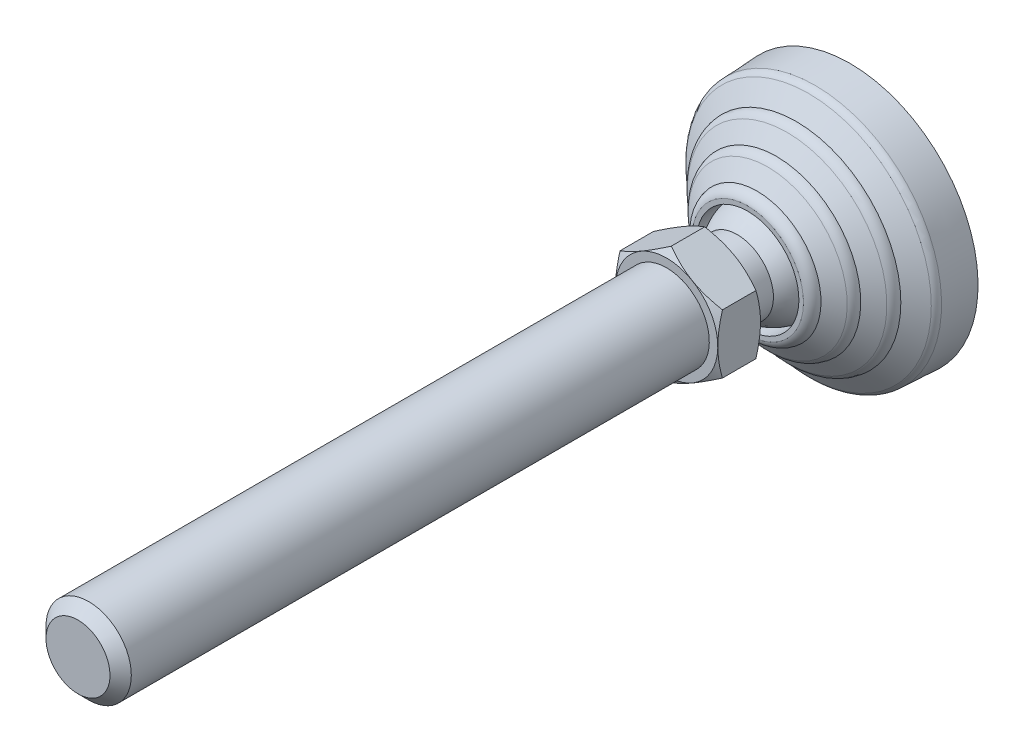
ISO-10303-21;
HEADER;
FILE_DESCRIPTION(('STEP AP214'),'2;1');
FILE_NAME('part.step','',(''),(''),'','','');
FILE_SCHEMA(('AUTOMOTIVE_DESIGN { 1 0 10303 214 1 1 1 1 }'));
ENDSEC;
DATA;
#1=APPLICATION_CONTEXT('core data for automotive mechanical design processes');
#2=APPLICATION_PROTOCOL_DEFINITION('international standard','automotive_design',2000,#1);
#3=PRODUCT_CONTEXT('',#1,'mechanical');
#4=PRODUCT('Part','Part','',(#3));
#5=PRODUCT_RELATED_PRODUCT_CATEGORY('part','',(#4));
#6=PRODUCT_DEFINITION_FORMATION('','',#4);
#7=PRODUCT_DEFINITION_CONTEXT('part definition',#1,'design');
#8=PRODUCT_DEFINITION('design','',#6,#7);
#9=PRODUCT_DEFINITION_SHAPE('','',#8);
#10=(LENGTH_UNIT() NAMED_UNIT(*) SI_UNIT(.MILLI.,.METRE.));
#11=(NAMED_UNIT(*) PLANE_ANGLE_UNIT() SI_UNIT($,.RADIAN.));
#12=(NAMED_UNIT(*) SI_UNIT($,.STERADIAN.) SOLID_ANGLE_UNIT());
#13=UNCERTAINTY_MEASURE_WITH_UNIT(LENGTH_MEASURE(1.E-05),#10,'distance_accuracy_value','');
#14=(GEOMETRIC_REPRESENTATION_CONTEXT(3) GLOBAL_UNCERTAINTY_ASSIGNED_CONTEXT((#13)) GLOBAL_UNIT_ASSIGNED_CONTEXT((#10,
#11,#12)) REPRESENTATION_CONTEXT('',''));
#15=CARTESIAN_POINT('',(0.,0.,0.));
#16=DIRECTION('',(0.,0.,1.));
#17=DIRECTION('',(1.,0.,0.));
#18=AXIS2_PLACEMENT_3D('',#15,#16,#17);
#19=CARTESIAN_POINT('',(0.,0.,110.4665));
#20=DIRECTION('',(0.,0.,-1.));
#21=DIRECTION('',(0.,1.,0.));
#22=AXIS2_PLACEMENT_3D('',#19,#20,#21);
#23=CYLINDRICAL_SURFACE('',#22,10.);
#24=CARTESIAN_POINT('',(0.,0.,178.5));
#25=DIRECTION('',(0.,0.,1.));
#26=DIRECTION('',(0.,-1.,0.));
#27=AXIS2_PLACEMENT_3D('',#24,#25,#26);
#28=CIRCLE('',#27,10.);
#29=CARTESIAN_POINT('',(0.,-10.,178.5));
#30=VERTEX_POINT('',#29);
#31=EDGE_CURVE('E9',#30,#30,#28,.F.);
#32=ORIENTED_EDGE('',*,*,#31,.T.);
#33=EDGE_LOOP('',(#32));
#34=FACE_BOUND('',#33,.T.);
#35=CARTESIAN_POINT('',(0.,0.,43.));
#36=DIRECTION('',(0.,0.,-1.));
#37=DIRECTION('',(0.,1.,0.));
#38=AXIS2_PLACEMENT_3D('',#35,#36,#37);
#39=CIRCLE('',#38,10.);
#40=CARTESIAN_POINT('',(0.,10.,43.));
#41=VERTEX_POINT('',#40);
#42=EDGE_CURVE('E124',#41,#41,#39,.F.);
#43=ORIENTED_EDGE('',*,*,#42,.T.);
#44=EDGE_LOOP('',(#43));
#45=FACE_BOUND('',#44,.T.);
#46=ADVANCED_FACE('F14',(#34,#45),#23,.T.);
#47=CARTESIAN_POINT('',(10.995,0.,43.));
#48=DIRECTION('',(0.,0.,1.));
#49=DIRECTION('',(0.,-1.,0.));
#50=AXIS2_PLACEMENT_3D('',#47,#48,#49);
#51=PLANE('',#50);
#52=CARTESIAN_POINT('',(0.,0.,43.));
#53=DIRECTION('',(0.,0.,-1.));
#54=DIRECTION('',(0.,1.,0.));
#55=AXIS2_PLACEMENT_3D('',#52,#53,#54);
#56=CIRCLE('',#55,11.99);
#57=CARTESIAN_POINT('',(0.,11.99,43.));
#58=VERTEX_POINT('',#57);
#59=EDGE_CURVE('E132',#58,#58,#56,.F.);
#60=ORIENTED_EDGE('',*,*,#59,.T.);
#61=EDGE_LOOP('',(#60));
#62=FACE_BOUND('',#61,.T.);
#63=ORIENTED_EDGE('',*,*,#42,.F.);
#64=EDGE_LOOP('',(#63));
#65=FACE_BOUND('',#64,.T.);
#66=ADVANCED_FACE('F157',(#62,#65),#51,.T.);
#67=CARTESIAN_POINT('',(0.,0.,41.9159643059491));
#68=DIRECTION('',(0.,0.,-1.));
#69=DIRECTION('',(0.,1.,0.));
#70=AXIS2_PLACEMENT_3D('',#67,#68,#69);
#71=CONICAL_SURFACE('',#70,13.8676048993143,1.0471975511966);
#72=ORIENTED_EDGE('',*,*,#59,.F.);
#73=EDGE_LOOP('',(#72));
#74=FACE_BOUND('',#73,.T.);
#75=CARTESIAN_POINT('',(-2.88482840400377E-08,-13.8564064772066,41.9224297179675));
#76=CARTESIAN_POINT('',(0.263784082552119,-13.7041106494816,42.0103407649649));
#77=CARTESIAN_POINT('',(0.528551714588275,-13.5512469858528,42.0942615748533));
#78=CARTESIAN_POINT('',(1.06021019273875,-13.2442938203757,42.2530155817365));
#79=CARTESIAN_POINT('',(1.32710170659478,-13.0902039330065,42.3278457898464));
#80=CARTESIAN_POINT('',(2.13207647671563,-12.6254515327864,42.537252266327));
#81=CARTESIAN_POINT('',(2.67333741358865,-12.3129543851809,42.6563603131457));
#82=CARTESIAN_POINT('',(3.48330954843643,-11.8453167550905,42.796023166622));
#83=CARTESIAN_POINT('',(3.74960108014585,-11.6915732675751,42.8358073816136));
#84=CARTESIAN_POINT('',(4.28341699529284,-11.3833745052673,42.9025217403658));
#85=CARTESIAN_POINT('',(4.55094140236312,-11.2289192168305,42.9294516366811));
#86=CARTESIAN_POINT('',(5.08643614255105,-10.9197511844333,42.9697675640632));
#87=CARTESIAN_POINT('',(5.35440556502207,-10.7650389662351,42.9831696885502));
#88=CARTESIAN_POINT('',(5.8905925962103,-10.4554712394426,42.996144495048));
#89=CARTESIAN_POINT('',(6.15881019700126,-10.3006157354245,42.9957176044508));
#90=CARTESIAN_POINT('',(6.66023029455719,-10.0111207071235,42.9820002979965));
#91=CARTESIAN_POINT('',(6.8934685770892,-9.87646052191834,42.97038309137));
#92=CARTESIAN_POINT('',(7.35940867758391,-9.60744987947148,42.9369099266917));
#93=CARTESIAN_POINT('',(7.59211045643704,-9.47309944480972,42.9150532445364));
#94=CARTESIAN_POINT('',(8.05685109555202,-9.20478131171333,42.8614821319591));
#95=CARTESIAN_POINT('',(8.28888924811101,-9.07081402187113,42.8297595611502));
#96=CARTESIAN_POINT('',(8.75187776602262,-8.80350747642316,42.7570131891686));
#97=CARTESIAN_POINT('',(8.9828280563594,-8.6701682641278,42.7159887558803));
#98=CARTESIAN_POINT('',(9.68388987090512,-8.26541003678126,42.5779256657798));
#99=CARTESIAN_POINT('',(10.1519713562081,-7.99516306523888,42.4671213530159));
#100=CARTESIAN_POINT('',(11.081155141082,-7.45869855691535,42.2156417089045));
#101=CARTESIAN_POINT('',(11.5422693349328,-7.19247415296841,42.075025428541));
#102=CARTESIAN_POINT('',(11.9999999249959,-6.92820327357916,41.922429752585));
#103=B_SPLINE_CURVE_WITH_KNOTS('',3,(#75,#76,#77,#78,#79,#80,#81,#82,#83,#84,#85,#86,#87,#88,
#89,#90,#91,#92,#93,#94,#95,#96,#97,#98,#99,#100,#101,#102),.UNSPECIFIED.,.F.,.F.,(4,2,2,2,2,2,
2,2,2,2,2,2,2,4),(0.,0.950996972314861,1.90230578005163,3.80897261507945,4.73890631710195,
5.66885791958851,6.59770188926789,7.52651715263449,8.33503482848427,9.14360968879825,
9.95285348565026,10.7621522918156,12.4163368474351,14.0672749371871),.UNSPECIFIED.);
#104=CARTESIAN_POINT('',(-1.44241383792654E-08,-13.8564064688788,41.9224297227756));
#105=VERTEX_POINT('',#104);
#106=CARTESIAN_POINT('',(12.,-6.92820324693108,41.9224297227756));
#107=VERTEX_POINT('',#106);
#108=EDGE_CURVE('E143',#105,#107,#103,.T.);
#109=ORIENTED_EDGE('',*,*,#108,.T.);
#110=CARTESIAN_POINT('',(12.,-6.92820326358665,41.9224297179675));
#111=CARTESIAN_POINT('',(12.,-6.64374493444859,42.0045333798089));
#112=CARTESIAN_POINT('',(12.,-6.35829458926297,42.0831531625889));
#113=CARTESIAN_POINT('',(12.,-5.78524260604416,42.2325348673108));
#114=CARTESIAN_POINT('',(12.,-5.49764024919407,42.3032940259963));
#115=CARTESIAN_POINT('',(12.,-4.63053083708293,42.5026195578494));
#116=CARTESIAN_POINT('',(12.,-4.04782834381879,42.6179071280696));
#117=CARTESIAN_POINT('',(12.,-3.17548925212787,42.7575170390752));
#118=CARTESIAN_POINT('',(12.,-2.88840964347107,42.7982045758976));
#119=CARTESIAN_POINT('',(12.,-2.31290718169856,42.8685767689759));
#120=CARTESIAN_POINT('',(12.,-2.02448443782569,42.8982623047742));
#121=CARTESIAN_POINT('',(12.,-1.44696804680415,42.9459902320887));
#122=CARTESIAN_POINT('',(12.,-1.15787537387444,42.9640443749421));
#123=CARTESIAN_POINT('',(12.,-0.579188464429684,42.9881624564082));
#124=CARTESIAN_POINT('',(12.,-0.289594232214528,42.994226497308));
#125=CARTESIAN_POINT('',(12.,0.289594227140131,42.9942264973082));
#126=CARTESIAN_POINT('',(12.,0.579188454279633,42.9881624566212));
#127=CARTESIAN_POINT('',(12.,1.15787535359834,42.9640443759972));
#128=CARTESIAN_POINT('',(12.,1.44696802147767,42.9459902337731));
#129=CARTESIAN_POINT('',(12.,2.02448440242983,42.8982623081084));
#130=CARTESIAN_POINT('',(12.,2.31290714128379,42.8685767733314));
#131=CARTESIAN_POINT('',(12.,2.88840959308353,42.798204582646));
#132=CARTESIAN_POINT('',(12.,3.17548919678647,42.7575170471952));
#133=CARTESIAN_POINT('',(12.,4.04782827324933,42.6179071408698));
#134=CARTESIAN_POINT('',(12.,4.63053075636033,42.5026195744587));
#135=CARTESIAN_POINT('',(12.,5.49764015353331,42.3032940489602));
#136=CARTESIAN_POINT('',(12.,5.78524250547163,42.2325348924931));
#137=CARTESIAN_POINT('',(12.,6.35829447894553,42.0831531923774));
#138=CARTESIAN_POINT('',(12.,6.64374481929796,42.004533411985));
#139=CARTESIAN_POINT('',(12.,6.92820314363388,41.9224297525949));
#140=B_SPLINE_CURVE_WITH_KNOTS('',3,(#110,#111,#112,#113,#114,#115,#116,#117,#118,#119,#120,
#121,#122,#123,#124,#125,#126,#127,#128,#129,#130,#131,#132,#133,#134,#135,#136,#137,#138,#139),
.UNSPECIFIED.,.F.,.F.,(4,2,2,2,2,2,2,2,2,2,2,2,2,2,4),(0.,0.888148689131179,1.77660860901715,
3.55698615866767,4.42666281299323,5.2962699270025,6.16499708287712,7.03371682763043,
7.90243655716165,8.7711636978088,9.64077079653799,10.5104474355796,12.2908249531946,
13.1792848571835,14.0674335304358),.UNSPECIFIED.);
#141=CARTESIAN_POINT('',(12.0000000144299,6.92820322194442,41.9224297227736));
#142=VERTEX_POINT('',#141);
#143=EDGE_CURVE('E135',#107,#142,#140,.T.);
#144=ORIENTED_EDGE('',*,*,#143,.T.);
#145=CARTESIAN_POINT('',(12.0000000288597,6.92820321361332,41.9224297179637));
#146=CARTESIAN_POINT('',(11.7362159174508,7.08049904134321,42.0103407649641));
#147=CARTESIAN_POINT('',(11.4714482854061,7.23336270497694,42.0942615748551));
#148=CARTESIAN_POINT('',(10.9397898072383,7.54031587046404,42.2530155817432));
#149=CARTESIAN_POINT('',(10.6728982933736,7.69440575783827,42.3278457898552));
#150=CARTESIAN_POINT('',(9.86792352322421,8.15915815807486,42.5372522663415));
#151=CARTESIAN_POINT('',(9.32666258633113,8.47165530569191,42.6563603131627));
#152=CARTESIAN_POINT('',(8.51669045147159,8.93929293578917,42.7960231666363));
#153=CARTESIAN_POINT('',(8.25039891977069,9.0930364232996,42.8358073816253));
#154=CARTESIAN_POINT('',(7.71658300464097,9.40123518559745,42.9025217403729));
#155=CARTESIAN_POINT('',(7.44905859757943,9.55569047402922,42.9294516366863));
#156=CARTESIAN_POINT('',(6.91356385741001,9.86485850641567,42.9697675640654));
#157=CARTESIAN_POINT('',(6.64559443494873,10.0195707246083,42.9831696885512));
#158=CARTESIAN_POINT('',(6.10940740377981,10.3291384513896,42.996144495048));
#159=CARTESIAN_POINT('',(5.84118980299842,10.4839939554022,42.9957176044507));
#160=CARTESIAN_POINT('',(5.33976970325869,10.773488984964,42.9820002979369));
#161=CARTESIAN_POINT('',(5.10653141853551,10.9081491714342,42.970383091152));
#162=CARTESIAN_POINT('',(4.64059131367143,11.1771598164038,42.9369099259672));
#163=CARTESIAN_POINT('',(4.4078895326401,11.3115102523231,42.9150532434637));
#164=CARTESIAN_POINT('',(3.94314888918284,11.5798283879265,42.8614821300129));
#165=CARTESIAN_POINT('',(3.71111073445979,11.7137956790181,42.8297595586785));
#166=CARTESIAN_POINT('',(3.24812221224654,11.9811022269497,42.7570131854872));
#167=CARTESIAN_POINT('',(3.01717191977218,12.1144414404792,42.7159887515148));
#168=CARTESIAN_POINT('',(2.31611009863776,12.5191996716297,42.5779256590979));
#169=CARTESIAN_POINT('',(1.84802860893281,12.7894466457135,42.4671213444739));
#170=CARTESIAN_POINT('',(0.918844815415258,13.3259111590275,42.2156416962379));
#171=CARTESIAN_POINT('',(0.457730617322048,13.5921355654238,42.0750254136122));
#172=CARTESIAN_POINT('',(2.30778996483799E-08,13.856406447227,41.9224297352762));
#173=B_SPLINE_CURVE_WITH_KNOTS('',3,(#145,#146,#147,#148,#149,#150,#151,#152,#153,#154,#155,
#156,#157,#158,#159,#160,#161,#162,#163,#164,#165,#166,#167,#168,#169,#170,#171,#172),
.UNSPECIFIED.,.F.,.F.,(4,2,2,2,2,2,2,2,2,2,2,2,2,4),(0.,0.95099697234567,1.9023057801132,
3.8089726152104,4.73890631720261,5.66885791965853,6.59770188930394,7.52651715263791,
8.33503483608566,9.14360970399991,9.95285350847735,10.7621523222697,12.4163368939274,
14.0672749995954),.UNSPECIFIED.);
#174=CARTESIAN_POINT('',(-1.15389591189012E-08,13.856406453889,41.92242973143));
#175=VERTEX_POINT('',#174);
#176=EDGE_CURVE('E180',#142,#175,#173,.T.);
#177=ORIENTED_EDGE('',*,*,#176,.T.);
#178=CARTESIAN_POINT('',(-2.30779115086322E-08,13.856406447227,41.9224297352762));
#179=CARTESIAN_POINT('',(-0.263784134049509,13.7041106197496,42.0103407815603));
#180=CARTESIAN_POINT('',(-0.528551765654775,13.5512469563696,42.0942615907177));
#181=CARTESIAN_POINT('',(-1.06021024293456,13.2442937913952,42.2530155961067));
#182=CARTESIAN_POINT('',(-1.32710175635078,13.0902039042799,42.3278458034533));
#183=CARTESIAN_POINT('',(-2.13207652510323,12.6254515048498,42.5372522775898));
#184=CARTESIAN_POINT('',(-2.6733374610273,12.3129543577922,42.656360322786));
#185=CARTESIAN_POINT('',(-3.48330959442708,11.8453167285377,42.7960231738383));
#186=CARTESIAN_POINT('',(-3.74960112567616,11.6915732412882,42.8358073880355));
#187=CARTESIAN_POINT('',(-4.28341703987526,11.3833744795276,42.9025217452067));
#188=CARTESIAN_POINT('',(-4.550941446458,11.2289191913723,42.9294516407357));
#189=CARTESIAN_POINT('',(-5.08643618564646,10.9197511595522,42.9697675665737));
#190=CARTESIAN_POINT('',(-5.35440560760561,10.7650389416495,42.9831696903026));
#191=CARTESIAN_POINT('',(-5.89059263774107,10.4554712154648,42.9961444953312));
#192=CARTESIAN_POINT('',(-6.15881023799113,10.300615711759,42.9957176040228));
#193=CARTESIAN_POINT('',(-6.66023033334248,10.0111206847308,42.9820002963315));
#194=CARTESIAN_POINT('',(-6.89346861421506,9.87646050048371,42.9703830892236));
#195=CARTESIAN_POINT('',(-7.359408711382,9.60744985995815,42.9369099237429));
#196=CARTESIAN_POINT('',(-7.59211048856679,9.4730994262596,42.9150532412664));
#197=CARTESIAN_POINT('',(-8.05685112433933,9.20478129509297,42.8614821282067));
#198=CARTESIAN_POINT('',(-8.28888927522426,9.07081400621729,42.8297595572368));
#199=CARTESIAN_POINT('',(-8.75187778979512,8.8035074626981,42.7570131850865));
#200=CARTESIAN_POINT('',(-8.98282807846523,8.67016825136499,42.7159887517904));
#201=CARTESIAN_POINT('',(-9.68388988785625,8.26541002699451,42.5779256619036));
#202=CARTESIAN_POINT('',(-10.1519713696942,7.9951630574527,42.4671213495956));
#203=CARTESIAN_POINT('',(-11.0811551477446,7.45869855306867,42.2156417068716));
#204=CARTESIAN_POINT('',(-11.5422693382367,7.19247415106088,42.0750254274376));
#205=CARTESIAN_POINT('',(-11.9999999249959,6.92820327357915,41.922429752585));
#206=B_SPLINE_CURVE_WITH_KNOTS('',3,(#178,#179,#180,#181,#182,#183,#184,#185,#186,#187,#188,
#189,#190,#191,#192,#193,#194,#195,#196,#197,#198,#199,#200,#201,#202,#203,#204,#205),
.UNSPECIFIED.,.F.,.F.,(4,2,2,2,2,2,2,2,2,2,2,2,2,4),(0.,0.9509969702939,1.90230577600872,
3.80897260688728,4.73890630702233,5.6688579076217,6.59770187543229,7.52651713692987,
8.33503480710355,9.14360966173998,9.95285345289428,10.7621522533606,12.4163367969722,
14.0672748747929),.UNSPECIFIED.);
#207=CARTESIAN_POINT('',(-12.,6.92820324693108,41.9224297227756));
#208=VERTEX_POINT('',#207);
#209=EDGE_CURVE('E172',#175,#208,#206,.T.);
#210=ORIENTED_EDGE('',*,*,#209,.T.);
#211=CARTESIAN_POINT('',(-12.,6.92820326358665,41.9224297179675));
#212=CARTESIAN_POINT('',(-12.,6.64374493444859,42.0045333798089));
#213=CARTESIAN_POINT('',(-12.,6.35829458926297,42.0831531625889));
#214=CARTESIAN_POINT('',(-12.,5.78524260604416,42.2325348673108));
#215=CARTESIAN_POINT('',(-12.,5.49764024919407,42.3032940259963));
#216=CARTESIAN_POINT('',(-12.,4.63053083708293,42.5026195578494));
#217=CARTESIAN_POINT('',(-12.,4.04782834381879,42.6179071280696));
#218=CARTESIAN_POINT('',(-12.,3.17548925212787,42.7575170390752));
#219=CARTESIAN_POINT('',(-12.,2.88840964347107,42.7982045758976));
#220=CARTESIAN_POINT('',(-12.,2.31290718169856,42.8685767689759));
#221=CARTESIAN_POINT('',(-12.,2.02448443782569,42.8982623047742));
#222=CARTESIAN_POINT('',(-12.,1.44696804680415,42.9459902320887));
#223=CARTESIAN_POINT('',(-12.,1.15787537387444,42.9640443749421));
#224=CARTESIAN_POINT('',(-12.,0.579188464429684,42.9881624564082));
#225=CARTESIAN_POINT('',(-12.,0.289594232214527,42.994226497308));
#226=CARTESIAN_POINT('',(-12.,-0.289594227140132,42.9942264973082));
#227=CARTESIAN_POINT('',(-12.,-0.579188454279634,42.9881624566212));
#228=CARTESIAN_POINT('',(-12.,-1.15787535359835,42.9640443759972));
#229=CARTESIAN_POINT('',(-12.,-1.44696802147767,42.9459902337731));
#230=CARTESIAN_POINT('',(-12.,-2.02448440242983,42.8982623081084));
#231=CARTESIAN_POINT('',(-12.,-2.31290714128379,42.8685767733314));
#232=CARTESIAN_POINT('',(-12.,-2.88840959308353,42.798204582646));
#233=CARTESIAN_POINT('',(-12.,-3.17548919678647,42.7575170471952));
#234=CARTESIAN_POINT('',(-12.,-4.04782827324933,42.6179071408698));
#235=CARTESIAN_POINT('',(-12.,-4.63053075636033,42.5026195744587));
#236=CARTESIAN_POINT('',(-12.,-5.49764015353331,42.3032940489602));
#237=CARTESIAN_POINT('',(-12.,-5.78524250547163,42.2325348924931));
#238=CARTESIAN_POINT('',(-12.,-6.35829447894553,42.0831531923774));
#239=CARTESIAN_POINT('',(-12.,-6.64374481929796,42.004533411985));
#240=CARTESIAN_POINT('',(-12.,-6.92820314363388,41.9224297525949));
#241=B_SPLINE_CURVE_WITH_KNOTS('',3,(#211,#212,#213,#214,#215,#216,#217,#218,#219,#220,#221,
#222,#223,#224,#225,#226,#227,#228,#229,#230,#231,#232,#233,#234,#235,#236,#237,#238,#239,#240),
.UNSPECIFIED.,.F.,.F.,(4,2,2,2,2,2,2,2,2,2,2,2,2,2,4),(0.,0.888148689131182,1.77660860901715,
3.55698615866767,4.42666281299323,5.2962699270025,6.16499708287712,7.03371682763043,
7.90243655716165,8.7711636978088,9.64077079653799,10.5104474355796,12.2908249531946,
13.1792848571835,14.0674335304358),.UNSPECIFIED.);
#242=CARTESIAN_POINT('',(-12.0000000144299,-6.92820322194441,41.9224297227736));
#243=VERTEX_POINT('',#242);
#244=EDGE_CURVE('E342',#208,#243,#241,.T.);
#245=ORIENTED_EDGE('',*,*,#244,.T.);
#246=CARTESIAN_POINT('',(-12.0000000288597,-6.92820321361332,41.9224297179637));
#247=CARTESIAN_POINT('',(-11.7362159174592,-7.08049904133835,42.0103407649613));
#248=CARTESIAN_POINT('',(-11.471448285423,-7.23336270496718,42.0942615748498));
#249=CARTESIAN_POINT('',(-10.9397898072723,-7.54031587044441,42.2530155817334));
#250=CARTESIAN_POINT('',(-10.6728982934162,-7.69440575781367,42.3278457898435));
#251=CARTESIAN_POINT('',(-9.86792352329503,-8.15915815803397,42.5372522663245));
#252=CARTESIAN_POINT('',(-9.3266625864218,-8.47165530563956,42.6563603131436));
#253=CARTESIAN_POINT('',(-8.5166904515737,-8.93929293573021,42.7960231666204));
#254=CARTESIAN_POINT('',(-8.25039891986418,-9.09303642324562,42.8358073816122));
#255=CARTESIAN_POINT('',(-7.71658300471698,-9.40123518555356,42.9025217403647));
#256=CARTESIAN_POINT('',(-7.44905859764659,-9.55569047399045,42.9294516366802));
#257=CARTESIAN_POINT('',(-6.91356385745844,-9.8648585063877,42.9697675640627));
#258=CARTESIAN_POINT('',(-6.64559443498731,-10.019570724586,42.9831696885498));
#259=CARTESIAN_POINT('',(-6.10940740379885,-10.3291384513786,42.996144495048));
#260=CARTESIAN_POINT('',(-5.84118980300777,-10.4839939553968,42.9957176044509));
#261=CARTESIAN_POINT('',(-5.33976970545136,-10.7734889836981,42.9820002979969));
#262=CARTESIAN_POINT('',(-5.10653142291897,-10.9081491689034,42.9703830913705));
#263=CARTESIAN_POINT('',(-4.64059132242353,-11.1771598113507,42.9369099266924));
#264=CARTESIAN_POINT('',(-4.40788954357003,-11.3115102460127,42.9150532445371));
#265=CARTESIAN_POINT('',(-3.94314890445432,-11.5798283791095,42.8614821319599));
#266=CARTESIAN_POINT('',(-3.71111075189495,-11.7137956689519,42.829759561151));
#267=CARTESIAN_POINT('',(-3.24812223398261,-11.9811022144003,42.7570131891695));
#268=CARTESIAN_POINT('',(-3.01717194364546,-12.1144414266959,42.7159887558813));
#269=CARTESIAN_POINT('',(-2.3161101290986,-12.5191996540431,42.5779256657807));
#270=CARTESIAN_POINT('',(-1.84802864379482,-12.7894466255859,42.4671213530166));
#271=CARTESIAN_POINT('',(-0.918844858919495,-13.3259111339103,42.215641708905));
#272=CARTESIAN_POINT('',(-0.457730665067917,-13.5921355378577,42.0750254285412));
#273=CARTESIAN_POINT('',(-7.50040961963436E-08,-13.8564064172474,41.922429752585));
#274=B_SPLINE_CURVE_WITH_KNOTS('',3,(#246,#247,#248,#249,#250,#251,#252,#253,#254,#255,#256,
#257,#258,#259,#260,#261,#262,#263,#264,#265,#266,#267,#268,#269,#270,#271,#272,#273),
.UNSPECIFIED.,.F.,.F.,(4,2,2,2,2,2,2,2,2,2,2,2,2,4),(0.,0.950996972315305,1.90230578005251,
3.80897261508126,4.73890631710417,5.66885791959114,6.59770188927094,7.52651715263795,
8.33503482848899,9.14360968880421,9.95285348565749,10.7621522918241,12.4163368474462,
14.0672749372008),.UNSPECIFIED.);
#275=EDGE_CURVE('E162',#243,#105,#274,.T.);
#276=ORIENTED_EDGE('',*,*,#275,.T.);
#277=EDGE_LOOP('',(#109,#144,#177,#210,#245,#276));
#278=FACE_BOUND('',#277,.T.);
#279=ADVANCED_FACE('F152',(#74,#278),#71,.T.);
#280=CARTESIAN_POINT('',(0.,-13.856406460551,43.1));
#281=DIRECTION('',(0.5,0.866025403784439,0.));
#282=DIRECTION('',(-0.866025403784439,0.5,0.));
#283=AXIS2_PLACEMENT_3D('',#280,#281,#282);
#284=PLANE('',#283);
#285=DIRECTION('',(0.,0.,1.));
#286=VECTOR('',#285,1.);
#287=CARTESIAN_POINT('',(0.,-13.856406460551,43.1));
#288=LINE('',#287,#286);
#289=CARTESIAN_POINT('',(0.,-13.856406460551,34.0775702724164));
#290=VERTEX_POINT('',#289);
#291=EDGE_CURVE('E368',#290,#105,#288,.T.);
#292=ORIENTED_EDGE('',*,*,#291,.T.);
#293=ORIENTED_EDGE('',*,*,#275,.F.);
#294=DIRECTION('',(0.,0.,1.));
#295=VECTOR('',#294,1.);
#296=CARTESIAN_POINT('',(-12.,-6.9282032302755,43.1));
#297=LINE('',#296,#295);
#298=CARTESIAN_POINT('',(-12.,-6.9282032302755,34.0775702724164));
#299=VERTEX_POINT('',#298);
#300=EDGE_CURVE('E360',#299,#243,#297,.T.);
#301=ORIENTED_EDGE('',*,*,#300,.F.);
#302=CARTESIAN_POINT('',(0.,-13.856406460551,34.0775702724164));
#303=CARTESIAN_POINT('',(-0.263784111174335,-13.7041106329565,33.9896592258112));
#304=CARTESIAN_POINT('',(-0.528551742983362,-13.5512469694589,33.9057384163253));
#305=CARTESIAN_POINT('',(-1.0602102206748,-13.2442938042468,33.7469844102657));
#306=CARTESIAN_POINT('',(-1.32710173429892,-13.0902039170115,33.6721542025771));
#307=CARTESIAN_POINT('',(-2.13207650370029,-12.6254515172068,33.4627477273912));
#308=CARTESIAN_POINT('',(-2.67333744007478,-12.3129543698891,33.3436396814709));
#309=CARTESIAN_POINT('',(-3.48330957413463,-11.8453167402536,33.2039768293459));
#310=CARTESIAN_POINT('',(-3.74960110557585,-11.6915732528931,33.1641926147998));
#311=CARTESIAN_POINT('',(-4.28341702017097,-11.3833744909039,33.097478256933));
#312=CARTESIAN_POINT('',(-4.55094142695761,-11.2289192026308,33.0705483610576));
#313=CARTESIAN_POINT('',(-5.08643616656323,-10.9197511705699,33.0302324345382));
#314=CARTESIAN_POINT('',(-5.35440558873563,-10.765038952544,33.0168303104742));
#315=CARTESIAN_POINT('',(-5.89059261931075,-10.4554712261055,33.0038555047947));
#316=CARTESIAN_POINT('',(-6.15881021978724,-10.300615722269,33.0042823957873));
#317=CARTESIAN_POINT('',(-6.66023031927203,-10.0111206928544,33.0179997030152));
#318=CARTESIAN_POINT('',(-6.8934686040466,-9.87646050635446,33.029616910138));
#319=CARTESIAN_POINT('',(-7.35940870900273,-9.6074498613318,33.063090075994));
#320=CARTESIAN_POINT('',(-7.59211049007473,-9.47309942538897,33.0849467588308));
#321=CARTESIAN_POINT('',(-8.05685113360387,-9.20478128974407,33.1385178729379));
#322=CARTESIAN_POINT('',(-8.28888928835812,-9.07081399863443,33.1702404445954));
#323=CARTESIAN_POINT('',(-8.75187781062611,-8.8035074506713,33.2429868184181));
#324=CARTESIAN_POINT('',(-8.98282810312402,-8.67016823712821,33.2840112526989));
#325=CARTESIAN_POINT('',(-9.6838899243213,-8.2654100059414,33.4220743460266));
#326=CARTESIAN_POINT('',(-10.1519714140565,-7.99516303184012,33.5328786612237));
#327=CARTESIAN_POINT('',(-11.0811552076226,-7.45869851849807,33.7843583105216));
#328=CARTESIAN_POINT('',(-11.5422694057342,-7.19247411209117,33.924974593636));
#329=CARTESIAN_POINT('',(-12.,-6.9282032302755,34.0775702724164));
#330=B_SPLINE_CURVE_WITH_KNOTS('',3,(#302,#303,#304,#305,#306,#307,#308,#309,#310,#311,#312,
#313,#314,#315,#316,#317,#318,#319,#320,#321,#322,#323,#324,#325,#326,#327,#328,#329),
.UNSPECIFIED.,.F.,.F.,(4,2,2,2,2,2,2,2,2,2,2,2,2,4),(0.,0.950996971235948,1.90230577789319,
3.80897261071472,4.73890631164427,5.66885791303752,6.59770188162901,7.52651714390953,
8.33503482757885,9.14360969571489,9.9528535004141,10.7621523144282,12.4163368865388,
14.0672749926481),.UNSPECIFIED.);
#331=EDGE_CURVE('E362',#290,#299,#330,.T.);
#332=ORIENTED_EDGE('',*,*,#331,.F.);
#333=EDGE_LOOP('',(#292,#293,#301,#332));
#334=FACE_BOUND('',#333,.T.);
#335=ADVANCED_FACE('F156',(#334),#284,.F.);
#336=CARTESIAN_POINT('',(12.,-6.92820323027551,43.1));
#337=DIRECTION('',(-0.5,0.866025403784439,0.));
#338=DIRECTION('',(-0.866025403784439,-0.5,0.));
#339=AXIS2_PLACEMENT_3D('',#336,#337,#338);
#340=PLANE('',#339);
#341=DIRECTION('',(0.,0.,1.));
#342=VECTOR('',#341,1.);
#343=CARTESIAN_POINT('',(12.,-6.92820323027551,43.1));
#344=LINE('',#343,#342);
#345=CARTESIAN_POINT('',(12.,-6.92820323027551,34.0775702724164));
#346=VERTEX_POINT('',#345);
#347=EDGE_CURVE('E31',#346,#107,#344,.T.);
#348=ORIENTED_EDGE('',*,*,#347,.T.);
#349=ORIENTED_EDGE('',*,*,#108,.F.);
#350=ORIENTED_EDGE('',*,*,#291,.F.);
#351=CARTESIAN_POINT('',(12.,-6.92820323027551,34.0775702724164));
#352=CARTESIAN_POINT('',(11.7362158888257,-7.08049905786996,33.9896592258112));
#353=CARTESIAN_POINT('',(11.4714482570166,-7.2333627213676,33.9057384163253));
#354=CARTESIAN_POINT('',(10.9397897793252,-7.5403158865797,33.7469844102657));
#355=CARTESIAN_POINT('',(10.6728982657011,-7.69440577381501,33.6721542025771));
#356=CARTESIAN_POINT('',(9.86792349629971,-8.15915817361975,33.4627477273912));
#357=CARTESIAN_POINT('',(9.32666255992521,-8.4716553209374,33.3436396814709));
#358=CARTESIAN_POINT('',(8.51669042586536,-8.93929295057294,33.2039768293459));
#359=CARTESIAN_POINT('',(8.25039889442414,-9.09303643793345,33.1641926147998));
#360=CARTESIAN_POINT('',(7.71658297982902,-9.40123519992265,33.097478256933));
#361=CARTESIAN_POINT('',(7.44905857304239,-9.55569048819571,33.0705483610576));
#362=CARTESIAN_POINT('',(6.91356383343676,-9.86485852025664,33.0302324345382));
#363=CARTESIAN_POINT('',(6.64559441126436,-10.0195707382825,33.0168303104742));
#364=CARTESIAN_POINT('',(6.10940738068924,-10.329138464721,33.0038555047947));
#365=CARTESIAN_POINT('',(5.84118978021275,-10.4839939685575,33.0042823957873));
#366=CARTESIAN_POINT('',(5.33976968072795,-10.7734889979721,33.0179997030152));
#367=CARTESIAN_POINT('',(5.10653139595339,-10.9081491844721,33.029616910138));
#368=CARTESIAN_POINT('',(4.64059129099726,-11.1771598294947,33.063090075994));
#369=CARTESIAN_POINT('',(4.40788950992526,-11.3115102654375,33.0849467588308));
#370=CARTESIAN_POINT('',(3.94314886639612,-11.5798284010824,33.1385178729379));
#371=CARTESIAN_POINT('',(3.71111071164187,-11.7137956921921,33.1702404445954));
#372=CARTESIAN_POINT('',(3.24812218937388,-11.9811022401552,33.2429868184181));
#373=CARTESIAN_POINT('',(3.01717189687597,-12.1144414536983,33.2840112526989));
#374=CARTESIAN_POINT('',(2.3161100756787,-12.5191996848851,33.4220743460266));
#375=CARTESIAN_POINT('',(1.84802858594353,-12.7894466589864,33.5328786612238));
#376=CARTESIAN_POINT('',(0.918844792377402,-13.3259111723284,33.7843583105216));
#377=CARTESIAN_POINT('',(0.457730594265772,-13.5921355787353,33.924974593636));
#378=CARTESIAN_POINT('',(0.,-13.856406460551,34.0775702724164));
#379=B_SPLINE_CURVE_WITH_KNOTS('',3,(#351,#352,#353,#354,#355,#356,#357,#358,#359,#360,#361,
#362,#363,#364,#365,#366,#367,#368,#369,#370,#371,#372,#373,#374,#375,#376,#377,#378),
.UNSPECIFIED.,.F.,.F.,(4,2,2,2,2,2,2,2,2,2,2,2,2,4),(0.,0.95099697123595,1.90230577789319,
3.80897261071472,4.73890631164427,5.66885791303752,6.59770188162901,7.52651714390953,
8.33503482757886,9.14360969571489,9.9528535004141,10.7621523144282,12.4163368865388,
14.0672749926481),.UNSPECIFIED.);
#380=EDGE_CURVE('E369',#346,#290,#379,.T.);
#381=ORIENTED_EDGE('',*,*,#380,.F.);
#382=EDGE_LOOP('',(#348,#349,#350,#381));
#383=FACE_BOUND('',#382,.T.);
#384=ADVANCED_FACE('F375',(#383),#340,.F.);
#385=CARTESIAN_POINT('',(-12.,6.92820323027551,43.1));
#386=DIRECTION('',(0.5,-0.866025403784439,0.));
#387=DIRECTION('',(0.866025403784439,0.5,0.));
#388=AXIS2_PLACEMENT_3D('',#385,#386,#387);
#389=PLANE('',#388);
#390=DIRECTION('',(0.,0.,1.));
#391=VECTOR('',#390,1.);
#392=CARTESIAN_POINT('',(-12.,6.92820323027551,43.1));
#393=LINE('',#392,#391);
#394=CARTESIAN_POINT('',(-12.,6.92820323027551,34.0775702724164));
#395=VERTEX_POINT('',#394);
#396=EDGE_CURVE('E361',#395,#208,#393,.T.);
#397=ORIENTED_EDGE('',*,*,#396,.T.);
#398=ORIENTED_EDGE('',*,*,#209,.F.);
#399=DIRECTION('',(0.,0.,1.));
#400=VECTOR('',#399,1.);
#401=CARTESIAN_POINT('',(0.,13.856406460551,43.1));
#402=LINE('',#401,#400);
#403=CARTESIAN_POINT('',(0.,13.856406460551,34.0775702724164));
#404=VERTEX_POINT('',#403);
#405=EDGE_CURVE('E211',#404,#175,#402,.T.);
#406=ORIENTED_EDGE('',*,*,#405,.F.);
#407=CARTESIAN_POINT('',(-12.,6.92820323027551,34.0775702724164));
#408=CARTESIAN_POINT('',(-11.7362158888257,7.08049905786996,33.9896592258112));
#409=CARTESIAN_POINT('',(-11.4714482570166,7.2333627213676,33.9057384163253));
#410=CARTESIAN_POINT('',(-10.9397897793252,7.5403158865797,33.7469844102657));
#411=CARTESIAN_POINT('',(-10.6728982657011,7.69440577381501,33.6721542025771));
#412=CARTESIAN_POINT('',(-9.86792349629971,8.15915817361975,33.4627477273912));
#413=CARTESIAN_POINT('',(-9.32666255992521,8.4716553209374,33.3436396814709));
#414=CARTESIAN_POINT('',(-8.51669042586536,8.93929295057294,33.2039768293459));
#415=CARTESIAN_POINT('',(-8.25039889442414,9.09303643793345,33.1641926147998));
#416=CARTESIAN_POINT('',(-7.71658297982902,9.40123519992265,33.097478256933));
#417=CARTESIAN_POINT('',(-7.44905857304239,9.55569048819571,33.0705483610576));
#418=CARTESIAN_POINT('',(-6.91356383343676,9.86485852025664,33.0302324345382));
#419=CARTESIAN_POINT('',(-6.64559441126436,10.0195707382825,33.0168303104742));
#420=CARTESIAN_POINT('',(-6.10940738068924,10.329138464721,33.0038555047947));
#421=CARTESIAN_POINT('',(-5.84118978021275,10.4839939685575,33.0042823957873));
#422=CARTESIAN_POINT('',(-5.33976968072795,10.7734889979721,33.0179997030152));
#423=CARTESIAN_POINT('',(-5.10653139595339,10.9081491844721,33.029616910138));
#424=CARTESIAN_POINT('',(-4.64059129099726,11.1771598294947,33.063090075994));
#425=CARTESIAN_POINT('',(-4.40788950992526,11.3115102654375,33.0849467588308));
#426=CARTESIAN_POINT('',(-3.94314886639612,11.5798284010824,33.1385178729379));
#427=CARTESIAN_POINT('',(-3.71111071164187,11.7137956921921,33.1702404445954));
#428=CARTESIAN_POINT('',(-3.24812218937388,11.9811022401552,33.2429868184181));
#429=CARTESIAN_POINT('',(-3.01717189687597,12.1144414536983,33.2840112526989));
#430=CARTESIAN_POINT('',(-2.3161100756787,12.5191996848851,33.4220743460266));
#431=CARTESIAN_POINT('',(-1.84802858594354,12.7894466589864,33.5328786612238));
#432=CARTESIAN_POINT('',(-0.918844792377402,13.3259111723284,33.7843583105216));
#433=CARTESIAN_POINT('',(-0.457730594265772,13.5921355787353,33.924974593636));
#434=CARTESIAN_POINT('',(0.,13.856406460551,34.0775702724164));
#435=B_SPLINE_CURVE_WITH_KNOTS('',3,(#407,#408,#409,#410,#411,#412,#413,#414,#415,#416,#417,
#418,#419,#420,#421,#422,#423,#424,#425,#426,#427,#428,#429,#430,#431,#432,#433,#434),
.UNSPECIFIED.,.F.,.F.,(4,2,2,2,2,2,2,2,2,2,2,2,2,4),(0.,0.95099697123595,1.90230577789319,
3.80897261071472,4.73890631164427,5.66885791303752,6.59770188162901,7.52651714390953,
8.33503482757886,9.14360969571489,9.9528535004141,10.7621523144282,12.4163368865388,
14.0672749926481),.UNSPECIFIED.);
#436=EDGE_CURVE('E213',#395,#404,#435,.T.);
#437=ORIENTED_EDGE('',*,*,#436,.F.);
#438=EDGE_LOOP('',(#397,#398,#406,#437));
#439=FACE_BOUND('',#438,.T.);
#440=ADVANCED_FACE('F199',(#439),#389,.F.);
#441=CARTESIAN_POINT('',(-12.,-6.92820323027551,43.1));
#442=DIRECTION('',(1.,0.,0.));
#443=DIRECTION('',(0.,1.,0.));
#444=AXIS2_PLACEMENT_3D('',#441,#442,#443);
#445=PLANE('',#444);
#446=ORIENTED_EDGE('',*,*,#300,.T.);
#447=ORIENTED_EDGE('',*,*,#244,.F.);
#448=ORIENTED_EDGE('',*,*,#396,.F.);
#449=CARTESIAN_POINT('',(-12.,-6.9282032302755,34.0775702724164));
#450=CARTESIAN_POINT('',(-12.,-6.64374490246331,33.9954666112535));
#451=CARTESIAN_POINT('',(-12.,-6.35829455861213,33.9168468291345));
#452=CARTESIAN_POINT('',(-12.,-5.78524257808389,33.7674651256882));
#453=CARTESIAN_POINT('',(-12.,-5.49764022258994,33.6967059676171));
#454=CARTESIAN_POINT('',(-12.,-4.63053081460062,33.4973804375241));
#455=CARTESIAN_POINT('',(-12.,-4.04782832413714,33.3820928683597));
#456=CARTESIAN_POINT('',(-12.,-3.17548923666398,33.2424829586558));
#457=CARTESIAN_POINT('',(-12.,-2.88840962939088,33.2017954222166));
#458=CARTESIAN_POINT('',(-12.,-2.31290717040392,33.1314232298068));
#459=CARTESIAN_POINT('',(-12.,-2.02448442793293,33.1017376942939));
#460=CARTESIAN_POINT('',(-12.,-1.44696803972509,33.0540097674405));
#461=CARTESIAN_POINT('',(-12.,-1.1578753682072,33.035955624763));
#462=CARTESIAN_POINT('',(-12.,-0.579188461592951,33.0118375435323));
#463=CARTESIAN_POINT('',(-12.,-0.289594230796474,33.0057735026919));
#464=CARTESIAN_POINT('',(-12.,0.28959423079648,33.0057735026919));
#465=CARTESIAN_POINT('',(-12.,0.579188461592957,33.0118375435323));
#466=CARTESIAN_POINT('',(-12.,1.15787536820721,33.035955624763));
#467=CARTESIAN_POINT('',(-12.,1.4469680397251,33.0540097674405));
#468=CARTESIAN_POINT('',(-12.,2.02448442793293,33.1017376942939));
#469=CARTESIAN_POINT('',(-12.,2.31290717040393,33.1314232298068));
#470=CARTESIAN_POINT('',(-12.,2.88840962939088,33.2017954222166));
#471=CARTESIAN_POINT('',(-12.,3.17548923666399,33.2424829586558));
#472=CARTESIAN_POINT('',(-12.,4.04782832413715,33.3820928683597));
#473=CARTESIAN_POINT('',(-12.,4.63053081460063,33.4973804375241));
#474=CARTESIAN_POINT('',(-12.,5.49764022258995,33.6967059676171));
#475=CARTESIAN_POINT('',(-12.,5.7852425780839,33.7674651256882));
#476=CARTESIAN_POINT('',(-12.,6.35829455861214,33.9168468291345));
#477=CARTESIAN_POINT('',(-12.,6.64374490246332,33.9954666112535));
#478=CARTESIAN_POINT('',(-12.,6.92820323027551,34.0775702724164));
#479=B_SPLINE_CURVE_WITH_KNOTS('',3,(#449,#450,#451,#452,#453,#454,#455,#456,#457,#458,#459,
#460,#461,#462,#463,#464,#465,#466,#467,#468,#469,#470,#471,#472,#473,#474,#475,#476,#477,#478),
.UNSPECIFIED.,.F.,.F.,(4,2,2,2,2,2,2,2,2,2,2,2,2,2,4),(0.,0.888148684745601,1.77660860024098,
3.55698614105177,4.42666279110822,5.29626990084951,6.16499705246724,7.03371679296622,
7.90243653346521,8.77116368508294,9.64077079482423,10.5104474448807,12.2908249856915,
13.1792849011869,14.0674335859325),.UNSPECIFIED.);
#480=EDGE_CURVE('E354',#299,#395,#479,.T.);
#481=ORIENTED_EDGE('',*,*,#480,.F.);
#482=EDGE_LOOP('',(#446,#447,#448,#481));
#483=FACE_BOUND('',#482,.T.);
#484=ADVANCED_FACE('F348',(#483),#445,.F.);
#485=CARTESIAN_POINT('',(12.,6.92820323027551,43.1));
#486=DIRECTION('',(-1.,0.,0.));
#487=DIRECTION('',(0.,-1.,0.));
#488=AXIS2_PLACEMENT_3D('',#485,#486,#487);
#489=PLANE('',#488);
#490=DIRECTION('',(0.,0.,1.));
#491=VECTOR('',#490,1.);
#492=CARTESIAN_POINT('',(12.,6.92820323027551,43.1));
#493=LINE('',#492,#491);
#494=CARTESIAN_POINT('',(12.,6.9282032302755,34.0775702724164));
#495=VERTEX_POINT('',#494);
#496=EDGE_CURVE('E402',#142,#495,#493,.F.);
#497=ORIENTED_EDGE('',*,*,#496,.F.);
#498=ORIENTED_EDGE('',*,*,#143,.F.);
#499=ORIENTED_EDGE('',*,*,#347,.F.);
#500=CARTESIAN_POINT('',(12.,6.92820323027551,34.0775702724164));
#501=CARTESIAN_POINT('',(12.,6.64374490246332,33.9954666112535));
#502=CARTESIAN_POINT('',(12.,6.35829455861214,33.9168468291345));
#503=CARTESIAN_POINT('',(12.,5.7852425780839,33.7674651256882));
#504=CARTESIAN_POINT('',(12.,5.49764022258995,33.6967059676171));
#505=CARTESIAN_POINT('',(12.,4.63053081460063,33.4973804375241));
#506=CARTESIAN_POINT('',(12.,4.04782832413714,33.3820928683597));
#507=CARTESIAN_POINT('',(12.,3.17548923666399,33.2424829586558));
#508=CARTESIAN_POINT('',(12.,2.88840962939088,33.2017954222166));
#509=CARTESIAN_POINT('',(12.,2.31290717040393,33.1314232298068));
#510=CARTESIAN_POINT('',(12.,2.02448442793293,33.1017376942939));
#511=CARTESIAN_POINT('',(12.,1.4469680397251,33.0540097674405));
#512=CARTESIAN_POINT('',(12.,1.1578753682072,33.035955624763));
#513=CARTESIAN_POINT('',(12.,0.579188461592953,33.0118375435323));
#514=CARTESIAN_POINT('',(12.,0.289594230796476,33.0057735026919));
#515=CARTESIAN_POINT('',(12.,-0.289594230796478,33.0057735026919));
#516=CARTESIAN_POINT('',(12.,-0.579188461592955,33.0118375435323));
#517=CARTESIAN_POINT('',(12.,-1.15787536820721,33.035955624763));
#518=CARTESIAN_POINT('',(12.,-1.4469680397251,33.0540097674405));
#519=CARTESIAN_POINT('',(12.,-2.02448442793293,33.1017376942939));
#520=CARTESIAN_POINT('',(12.,-2.31290717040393,33.1314232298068));
#521=CARTESIAN_POINT('',(12.,-2.88840962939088,33.2017954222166));
#522=CARTESIAN_POINT('',(12.,-3.17548923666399,33.2424829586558));
#523=CARTESIAN_POINT('',(12.,-4.04782832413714,33.3820928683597));
#524=CARTESIAN_POINT('',(12.,-4.63053081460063,33.4973804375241));
#525=CARTESIAN_POINT('',(12.,-5.49764022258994,33.6967059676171));
#526=CARTESIAN_POINT('',(12.,-5.78524257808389,33.7674651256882));
#527=CARTESIAN_POINT('',(12.,-6.35829455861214,33.9168468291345));
#528=CARTESIAN_POINT('',(12.,-6.64374490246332,33.9954666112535));
#529=CARTESIAN_POINT('',(12.,-6.92820323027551,34.0775702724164));
#530=B_SPLINE_CURVE_WITH_KNOTS('',3,(#500,#501,#502,#503,#504,#505,#506,#507,#508,#509,#510,
#511,#512,#513,#514,#515,#516,#517,#518,#519,#520,#521,#522,#523,#524,#525,#526,#527,#528,#529),
.UNSPECIFIED.,.F.,.F.,(4,2,2,2,2,2,2,2,2,2,2,2,2,2,4),(0.,0.888148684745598,1.77660860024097,
3.55698614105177,4.42666279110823,5.29626990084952,6.16499705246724,7.03371679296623,
7.90243653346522,8.77116368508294,9.64077079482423,10.5104474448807,12.2908249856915,
13.1792849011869,14.0674335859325),.UNSPECIFIED.);
#531=EDGE_CURVE('E188',#495,#346,#530,.T.);
#532=ORIENTED_EDGE('',*,*,#531,.F.);
#533=EDGE_LOOP('',(#497,#498,#499,#532));
#534=FACE_BOUND('',#533,.T.);
#535=ADVANCED_FACE('F150',(#534),#489,.F.);
#536=CARTESIAN_POINT('',(0.,13.856406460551,43.1));
#537=DIRECTION('',(-0.5,-0.866025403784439,0.));
#538=DIRECTION('',(0.866025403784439,-0.5,0.));
#539=AXIS2_PLACEMENT_3D('',#536,#537,#538);
#540=PLANE('',#539);
#541=ORIENTED_EDGE('',*,*,#405,.T.);
#542=ORIENTED_EDGE('',*,*,#176,.F.);
#543=ORIENTED_EDGE('',*,*,#496,.T.);
#544=CARTESIAN_POINT('',(0.,13.856406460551,34.0775702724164));
#545=CARTESIAN_POINT('',(0.263784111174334,13.7041106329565,33.9896592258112));
#546=CARTESIAN_POINT('',(0.528551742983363,13.5512469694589,33.9057384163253));
#547=CARTESIAN_POINT('',(1.0602102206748,13.2442938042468,33.7469844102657));
#548=CARTESIAN_POINT('',(1.32710173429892,13.0902039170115,33.6721542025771));
#549=CARTESIAN_POINT('',(2.13207650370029,12.6254515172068,33.4627477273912));
#550=CARTESIAN_POINT('',(2.67333744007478,12.3129543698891,33.3436396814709));
#551=CARTESIAN_POINT('',(3.48330957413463,11.8453167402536,33.2039768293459));
#552=CARTESIAN_POINT('',(3.74960110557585,11.6915732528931,33.1641926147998));
#553=CARTESIAN_POINT('',(4.28341702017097,11.3833744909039,33.097478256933));
#554=CARTESIAN_POINT('',(4.55094142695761,11.2289192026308,33.0705483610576));
#555=CARTESIAN_POINT('',(5.08643616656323,10.9197511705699,33.0302324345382));
#556=CARTESIAN_POINT('',(5.35440558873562,10.765038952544,33.0168303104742));
#557=CARTESIAN_POINT('',(5.89059261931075,10.4554712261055,33.0038555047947));
#558=CARTESIAN_POINT('',(6.15881021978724,10.300615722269,33.0042823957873));
#559=CARTESIAN_POINT('',(6.66023031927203,10.0111206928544,33.0179997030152));
#560=CARTESIAN_POINT('',(6.8934686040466,9.87646050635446,33.029616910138));
#561=CARTESIAN_POINT('',(7.35940870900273,9.6074498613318,33.063090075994));
#562=CARTESIAN_POINT('',(7.59211049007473,9.47309942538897,33.0849467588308));
#563=CARTESIAN_POINT('',(8.05685113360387,9.20478128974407,33.1385178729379));
#564=CARTESIAN_POINT('',(8.28888928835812,9.07081399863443,33.1702404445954));
#565=CARTESIAN_POINT('',(8.75187781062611,8.8035074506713,33.2429868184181));
#566=CARTESIAN_POINT('',(8.98282810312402,8.67016823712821,33.2840112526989));
#567=CARTESIAN_POINT('',(9.6838899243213,8.2654100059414,33.4220743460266));
#568=CARTESIAN_POINT('',(10.1519714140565,7.99516303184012,33.5328786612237));
#569=CARTESIAN_POINT('',(11.0811552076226,7.45869851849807,33.7843583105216));
#570=CARTESIAN_POINT('',(11.5422694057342,7.19247411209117,33.924974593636));
#571=CARTESIAN_POINT('',(12.,6.9282032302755,34.0775702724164));
#572=B_SPLINE_CURVE_WITH_KNOTS('',3,(#544,#545,#546,#547,#548,#549,#550,#551,#552,#553,#554,
#555,#556,#557,#558,#559,#560,#561,#562,#563,#564,#565,#566,#567,#568,#569,#570,#571),
.UNSPECIFIED.,.F.,.F.,(4,2,2,2,2,2,2,2,2,2,2,2,2,4),(0.,0.950996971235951,1.90230577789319,
3.80897261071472,4.73890631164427,5.66885791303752,6.59770188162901,7.52651714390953,
8.33503482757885,9.14360969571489,9.9528535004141,10.7621523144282,12.4163368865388,
14.0672749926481),.UNSPECIFIED.);
#573=EDGE_CURVE('E68',#404,#495,#572,.T.);
#574=ORIENTED_EDGE('',*,*,#573,.F.);
#575=EDGE_LOOP('',(#541,#542,#543,#574));
#576=FACE_BOUND('',#575,.T.);
#577=ADVANCED_FACE('F195',(#576),#540,.F.);
#578=CARTESIAN_POINT('',(0.,0.,34.0840356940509));
#579=DIRECTION('',(0.,0.,1.));
#580=DIRECTION('',(0.,-1.,0.));
#581=AXIS2_PLACEMENT_3D('',#578,#579,#580);
#582=CONICAL_SURFACE('',#581,13.8676048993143,1.0471975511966);
#583=CARTESIAN_POINT('',(0.,0.,33.));
#584=DIRECTION('',(0.,0.,1.));
#585=DIRECTION('',(0.,-1.,0.));
#586=AXIS2_PLACEMENT_3D('',#583,#584,#585);
#587=CIRCLE('',#586,11.99);
#588=CARTESIAN_POINT('',(0.,-11.99,33.));
#589=VERTEX_POINT('',#588);
#590=EDGE_CURVE('E212',#589,#589,#587,.T.);
#591=ORIENTED_EDGE('',*,*,#590,.T.);
#592=EDGE_LOOP('',(#591));
#593=FACE_BOUND('',#592,.T.);
#594=ORIENTED_EDGE('',*,*,#573,.T.);
#595=ORIENTED_EDGE('',*,*,#531,.T.);
#596=ORIENTED_EDGE('',*,*,#380,.T.);
#597=ORIENTED_EDGE('',*,*,#331,.T.);
#598=ORIENTED_EDGE('',*,*,#480,.T.);
#599=ORIENTED_EDGE('',*,*,#436,.T.);
#600=EDGE_LOOP('',(#594,#595,#596,#597,#598,#599));
#601=FACE_BOUND('',#600,.T.);
#602=ADVANCED_FACE('F198',(#593,#601),#582,.T.);
#603=CARTESIAN_POINT('',(10.245,0.,33.));
#604=DIRECTION('',(0.,0.,-1.));
#605=DIRECTION('',(0.,1.,0.));
#606=AXIS2_PLACEMENT_3D('',#603,#604,#605);
#607=PLANE('',#606);
#608=CARTESIAN_POINT('',(0.,0.,33.));
#609=DIRECTION('',(0.,0.,-1.));
#610=DIRECTION('',(0.,1.,0.));
#611=AXIS2_PLACEMENT_3D('',#608,#609,#610);
#612=CIRCLE('',#611,8.5);
#613=CARTESIAN_POINT('',(0.,8.5,33.));
#614=VERTEX_POINT('',#613);
#615=EDGE_CURVE('E221',#614,#614,#612,.F.);
#616=ORIENTED_EDGE('',*,*,#615,.T.);
#617=EDGE_LOOP('',(#616));
#618=FACE_BOUND('',#617,.T.);
#619=ORIENTED_EDGE('',*,*,#590,.F.);
#620=EDGE_LOOP('',(#619));
#621=FACE_BOUND('',#620,.T.);
#622=ADVANCED_FACE('F429',(#618,#621),#607,.T.);
#623=CARTESIAN_POINT('',(0.,0.,29.7352685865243));
#624=DIRECTION('',(0.,0.,-1.));
#625=DIRECTION('',(0.,1.,0.));
#626=AXIS2_PLACEMENT_3D('',#623,#624,#625);
#627=CYLINDRICAL_SURFACE('',#626,8.5);
#628=ORIENTED_EDGE('',*,*,#615,.F.);
#629=EDGE_LOOP('',(#628));
#630=FACE_BOUND('',#629,.T.);
#631=CARTESIAN_POINT('',(0.,0.,26.4705371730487));
#632=DIRECTION('',(0.,0.,-1.));
#633=DIRECTION('',(0.,1.,0.));
#634=AXIS2_PLACEMENT_3D('',#631,#632,#633);
#635=CIRCLE('',#634,8.5);
#636=CARTESIAN_POINT('',(0.,8.5,26.4705371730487));
#637=VERTEX_POINT('',#636);
#638=EDGE_CURVE('E97',#637,#637,#635,.F.);
#639=ORIENTED_EDGE('',*,*,#638,.T.);
#640=EDGE_LOOP('',(#639));
#641=FACE_BOUND('',#640,.T.);
#642=ADVANCED_FACE('F117',(#630,#641),#627,.T.);
#643=CARTESIAN_POINT('',(0.,0.,18.));
#644=DIRECTION('',(1.,0.,0.));
#645=DIRECTION('',(0.,0.,1.));
#646=AXIS2_PLACEMENT_3D('',#643,#644,#645);
#647=SPHERICAL_SURFACE('',#646,12.);
#648=CARTESIAN_POINT('',(0.,0.,18.));
#649=DIRECTION('',(0.,0.,1.));
#650=DIRECTION('',(1.,0.,0.));
#651=AXIS2_PLACEMENT_3D('',#648,#649,#650);
#652=CIRCLE('',#651,12.);
#653=CARTESIAN_POINT('',(0.,12.,18.));
#654=VERTEX_POINT('',#653);
#655=CARTESIAN_POINT('',(-12.,0.,18.));
#656=VERTEX_POINT('',#655);
#657=EDGE_CURVE('E77',#654,#656,#652,.T.);
#658=ORIENTED_EDGE('',*,*,#657,.T.);
#659=CARTESIAN_POINT('',(-12.,0.,18.));
#660=CARTESIAN_POINT('',(-12.0000041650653,-0.196349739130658,18.));
#661=CARTESIAN_POINT('',(-11.9951810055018,-0.392699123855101,18.));
#662=CARTESIAN_POINT('',(-11.9759099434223,-0.784925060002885,18.));
#663=CARTESIAN_POINT('',(-11.9614620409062,-0.980801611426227,18.));
#664=CARTESIAN_POINT('',(-11.9229713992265,-1.37160975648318,18.));
#665=CARTESIAN_POINT('',(-11.8989286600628,-1.5665413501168,18.));
#666=CARTESIAN_POINT('',(-11.841307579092,-1.95499003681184,18.));
#667=CARTESIAN_POINT('',(-11.8077292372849,-2.14850712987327,18.));
#668=CARTESIAN_POINT('',(-11.7311174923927,-2.53366059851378,18.));
#669=CARTESIAN_POINT('',(-11.6880840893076,-2.72529697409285,18.));
#670=CARTESIAN_POINT('',(-11.5926659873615,-3.10622734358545,18.));
#671=CARTESIAN_POINT('',(-11.5402812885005,-3.29552133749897,18.));
#672=CARTESIAN_POINT('',(-11.4262867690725,-3.67131091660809,18.));
#673=CARTESIAN_POINT('',(-11.3646769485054,-3.85780650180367,18.));
#674=CARTESIAN_POINT('',(-11.2323806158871,-4.22754997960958,18.));
#675=CARTESIAN_POINT('',(-11.1616941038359,-4.41079787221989,18.));
#676=CARTESIAN_POINT('',(-11.011414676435,-4.77360450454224,18.));
#677=CARTESIAN_POINT('',(-10.9318217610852,-4.95316324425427,18.));
#678=CARTESIAN_POINT('',(-10.7639212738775,-5.30815899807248,18.));
#679=CARTESIAN_POINT('',(-10.6756137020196,-5.48359601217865,18.));
#680=CARTESIAN_POINT('',(-10.4904966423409,-5.82992567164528,17.9999999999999));
#681=CARTESIAN_POINT('',(-10.3936871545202,-6.00081831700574,17.9999999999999));
#682=CARTESIAN_POINT('',(-10.1917994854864,-6.33764754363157,17.9999999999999));
#683=CARTESIAN_POINT('',(-10.0867213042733,-6.50358412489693,17.9999999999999));
#684=CARTESIAN_POINT('',(-9.8685493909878,-6.83010146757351,17.9999999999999));
#685=CARTESIAN_POINT('',(-9.75545565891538,-6.99068222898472,17.9999999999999));
#686=CARTESIAN_POINT('',(-9.5215250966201,-7.30610107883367,17.9999999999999));
#687=CARTESIAN_POINT('',(-9.40068826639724,-7.4609391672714,17.9999999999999));
#688=CARTESIAN_POINT('',(-9.15156261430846,-7.76449965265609,17.9999999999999));
#689=CARTESIAN_POINT('',(-9.02327379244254,-7.91322204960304,17.9999999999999));
#690=CARTESIAN_POINT('',(-8.75955321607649,-8.20419286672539,17.9999999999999));
#691=CARTESIAN_POINT('',(-8.62412146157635,-8.3464412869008,17.9999999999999));
#692=CARTESIAN_POINT('',(-8.3464412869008,-8.62412146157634,17.9999999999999));
#693=CARTESIAN_POINT('',(-8.2041928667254,-8.75955321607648,17.9999999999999));
#694=CARTESIAN_POINT('',(-7.91322204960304,-9.02327379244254,17.9999999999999));
#695=CARTESIAN_POINT('',(-7.76449965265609,-9.15156261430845,17.9999999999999));
#696=CARTESIAN_POINT('',(-7.4609391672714,-9.40068826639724,17.9999999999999));
#697=CARTESIAN_POINT('',(-7.30610107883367,-9.5215250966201,17.9999999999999));
#698=CARTESIAN_POINT('',(-6.99068222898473,-9.75545565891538,17.9999999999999));
#699=CARTESIAN_POINT('',(-6.83010146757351,-9.8685493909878,17.9999999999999));
#700=CARTESIAN_POINT('',(-6.50358412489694,-10.0867213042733,17.9999999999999));
#701=CARTESIAN_POINT('',(-6.33764754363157,-10.1917994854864,17.9999999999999));
#702=CARTESIAN_POINT('',(-6.00081831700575,-10.3936871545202,17.9999999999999));
#703=CARTESIAN_POINT('',(-5.82992567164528,-10.4904966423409,17.9999999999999));
#704=CARTESIAN_POINT('',(-5.48359601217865,-10.6756137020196,17.9999999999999));
#705=CARTESIAN_POINT('',(-5.30815899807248,-10.7639212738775,17.9999999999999));
#706=CARTESIAN_POINT('',(-4.95316324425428,-10.9318217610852,17.9999999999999));
#707=CARTESIAN_POINT('',(-4.77360450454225,-11.011414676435,17.9999999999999));
#708=CARTESIAN_POINT('',(-4.4107978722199,-11.1616941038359,17.9999999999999));
#709=CARTESIAN_POINT('',(-4.22754997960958,-11.2323806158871,17.9999999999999));
#710=CARTESIAN_POINT('',(-3.85780650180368,-11.3646769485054,17.9999999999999));
#711=CARTESIAN_POINT('',(-3.67131091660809,-11.4262867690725,17.9999999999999));
#712=CARTESIAN_POINT('',(-3.29552133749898,-11.5402812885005,17.9999999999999));
#713=CARTESIAN_POINT('',(-3.10622734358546,-11.5926659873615,17.9999999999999));
#714=CARTESIAN_POINT('',(-2.72529697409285,-11.6880840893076,17.9999999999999));
#715=CARTESIAN_POINT('',(-2.53366059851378,-11.7311174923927,17.9999999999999));
#716=CARTESIAN_POINT('',(-2.14850712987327,-11.8077292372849,17.9999999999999));
#717=CARTESIAN_POINT('',(-1.95499003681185,-11.841307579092,17.9999999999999));
#718=CARTESIAN_POINT('',(-1.5665413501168,-11.8989286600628,17.9999999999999));
#719=CARTESIAN_POINT('',(-1.37160975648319,-11.9229713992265,17.9999999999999));
#720=CARTESIAN_POINT('',(-0.980801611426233,-11.9614620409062,17.9999999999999));
#721=CARTESIAN_POINT('',(-0.78492506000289,-11.9759099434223,17.9999999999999));
#722=CARTESIAN_POINT('',(-0.392699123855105,-11.9951810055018,17.9999999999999));
#723=CARTESIAN_POINT('',(-0.196349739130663,-12.0000041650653,17.9999999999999));
#724=CARTESIAN_POINT('',(0.,-12.,17.9999999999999));
#725=B_SPLINE_CURVE_WITH_KNOTS('',3,(#659,#660,#661,#662,#663,#664,#665,#666,#667,#668,#669,
#670,#671,#672,#673,#674,#675,#676,#677,#678,#679,#680,#681,#682,#683,#684,#685,#686,#687,#688,
#689,#690,#691,#692,#693,#694,#695,#696,#697,#698,#699,#700,#701,#702,#703,#704,#705,#706,#707,
#708,#709,#710,#711,#712,#713,#714,#715,#716,#717,#718,#719,#720,#721,#722,#723,#724),
.UNSPECIFIED.,.F.,.F.,(4,2,2,2,2,2,2,2,2,2,2,2,2,2,2,2,2,2,2,2,2,2,2,2,2,2,2,2,2,2,2,2,4),(0.,
0.588989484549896,1.17797896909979,1.76696845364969,2.35595793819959,2.94494742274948,
3.53393690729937,4.12292639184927,4.71191587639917,5.30090536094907,5.88989484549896,
6.47888433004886,7.06787381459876,7.65686329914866,8.24585278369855,8.83484226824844,
9.42383175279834,10.0128212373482,10.6018107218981,11.190800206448,11.7797896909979,
12.3687791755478,12.9577686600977,13.5467581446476,14.1357476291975,14.7247371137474,
15.3137265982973,15.9027160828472,16.4917055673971,17.080695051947,17.6696845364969,
18.2586740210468,18.8476635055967),.UNSPECIFIED.);
#726=CARTESIAN_POINT('',(0.,-12.,18.));
#727=VERTEX_POINT('',#726);
#728=EDGE_CURVE('E88',#656,#727,#725,.T.);
#729=ORIENTED_EDGE('',*,*,#728,.T.);
#730=CARTESIAN_POINT('',(0.,0.,18.));
#731=DIRECTION('',(0.,0.,-1.));
#732=DIRECTION('',(1.,0.,0.));
#733=AXIS2_PLACEMENT_3D('',#730,#731,#732);
#734=CIRCLE('',#733,12.);
#735=CARTESIAN_POINT('',(12.,0.,18.));
#736=VERTEX_POINT('',#735);
#737=EDGE_CURVE('E83',#727,#736,#734,.F.);
#738=ORIENTED_EDGE('',*,*,#737,.T.);
#739=CARTESIAN_POINT('',(12.,0.,18.));
#740=CARTESIAN_POINT('',(12.0000041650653,0.196349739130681,18.));
#741=CARTESIAN_POINT('',(11.9951810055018,0.392699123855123,18.));
#742=CARTESIAN_POINT('',(11.9759099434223,0.784925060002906,18.));
#743=CARTESIAN_POINT('',(11.9614620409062,0.980801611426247,18.));
#744=CARTESIAN_POINT('',(11.9229713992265,1.3716097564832,18.));
#745=CARTESIAN_POINT('',(11.8989286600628,1.56654135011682,18.));
#746=CARTESIAN_POINT('',(11.841307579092,1.95499003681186,18.));
#747=CARTESIAN_POINT('',(11.8077292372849,2.14850712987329,18.));
#748=CARTESIAN_POINT('',(11.7311174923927,2.53366059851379,18.));
#749=CARTESIAN_POINT('',(11.6880840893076,2.72529697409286,18.));
#750=CARTESIAN_POINT('',(11.5926659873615,3.10622734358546,18.));
#751=CARTESIAN_POINT('',(11.5402812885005,3.29552133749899,18.));
#752=CARTESIAN_POINT('',(11.4262867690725,3.6713109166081,18.));
#753=CARTESIAN_POINT('',(11.3646769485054,3.85780650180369,18.));
#754=CARTESIAN_POINT('',(11.2323806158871,4.22754997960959,18.));
#755=CARTESIAN_POINT('',(11.1616941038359,4.4107978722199,18.));
#756=CARTESIAN_POINT('',(11.011414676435,4.77360450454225,18.));
#757=CARTESIAN_POINT('',(10.9318217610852,4.95316324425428,18.));
#758=CARTESIAN_POINT('',(10.7639212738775,5.30815899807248,18.));
#759=CARTESIAN_POINT('',(10.6756137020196,5.48359601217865,18.));
#760=CARTESIAN_POINT('',(10.4904966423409,5.82992567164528,18.));
#761=CARTESIAN_POINT('',(10.3936871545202,6.00081831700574,18.));
#762=CARTESIAN_POINT('',(10.1917994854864,6.33764754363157,18.));
#763=CARTESIAN_POINT('',(10.0867213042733,6.50358412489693,18.));
#764=CARTESIAN_POINT('',(9.8685493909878,6.83010146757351,18.));
#765=CARTESIAN_POINT('',(9.75545565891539,6.99068222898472,18.));
#766=CARTESIAN_POINT('',(9.5215250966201,7.30610107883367,18.));
#767=CARTESIAN_POINT('',(9.40068826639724,7.4609391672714,18.));
#768=CARTESIAN_POINT('',(9.15156261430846,7.76449965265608,18.));
#769=CARTESIAN_POINT('',(9.02327379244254,7.91322204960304,18.));
#770=CARTESIAN_POINT('',(8.75955321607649,8.20419286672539,18.));
#771=CARTESIAN_POINT('',(8.62412146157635,8.3464412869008,18.));
#772=CARTESIAN_POINT('',(8.34644128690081,8.62412146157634,18.));
#773=CARTESIAN_POINT('',(8.20419286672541,8.75955321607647,18.));
#774=CARTESIAN_POINT('',(7.91322204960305,9.02327379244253,18.));
#775=CARTESIAN_POINT('',(7.7644996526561,9.15156261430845,18.));
#776=CARTESIAN_POINT('',(7.46093916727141,9.40068826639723,18.));
#777=CARTESIAN_POINT('',(7.30610107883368,9.52152509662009,18.));
#778=CARTESIAN_POINT('',(6.99068222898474,9.75545565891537,18.));
#779=CARTESIAN_POINT('',(6.83010146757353,9.86854939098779,18.));
#780=CARTESIAN_POINT('',(6.50358412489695,10.0867213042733,18.));
#781=CARTESIAN_POINT('',(6.33764754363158,10.1917994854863,18.));
#782=CARTESIAN_POINT('',(6.00081831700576,10.3936871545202,18.));
#783=CARTESIAN_POINT('',(5.8299256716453,10.4904966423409,18.));
#784=CARTESIAN_POINT('',(5.48359601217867,10.6756137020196,18.));
#785=CARTESIAN_POINT('',(5.3081589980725,10.7639212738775,18.));
#786=CARTESIAN_POINT('',(4.9531632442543,10.9318217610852,18.));
#787=CARTESIAN_POINT('',(4.77360450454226,11.0114146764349,18.));
#788=CARTESIAN_POINT('',(4.41079787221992,11.1616941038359,18.));
#789=CARTESIAN_POINT('',(4.2275499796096,11.2323806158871,18.));
#790=CARTESIAN_POINT('',(3.85780650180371,11.3646769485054,18.));
#791=CARTESIAN_POINT('',(3.67131091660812,11.4262867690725,18.));
#792=CARTESIAN_POINT('',(3.29552133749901,11.5402812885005,18.));
#793=CARTESIAN_POINT('',(3.10622734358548,11.5926659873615,18.));
#794=CARTESIAN_POINT('',(2.72529697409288,11.6880840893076,18.));
#795=CARTESIAN_POINT('',(2.53366059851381,11.7311174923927,18.));
#796=CARTESIAN_POINT('',(2.1485071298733,11.8077292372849,18.));
#797=CARTESIAN_POINT('',(1.95499003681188,11.841307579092,18.));
#798=CARTESIAN_POINT('',(1.56654135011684,11.8989286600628,18.));
#799=CARTESIAN_POINT('',(1.37160975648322,11.9229713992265,18.));
#800=CARTESIAN_POINT('',(0.980801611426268,11.9614620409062,18.));
#801=CARTESIAN_POINT('',(0.784925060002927,11.9759099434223,18.));
#802=CARTESIAN_POINT('',(0.392699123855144,11.9951810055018,18.));
#803=CARTESIAN_POINT('',(0.196349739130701,12.0000041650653,18.));
#804=CARTESIAN_POINT('',(0.,12.,18.));
#805=B_SPLINE_CURVE_WITH_KNOTS('',3,(#739,#740,#741,#742,#743,#744,#745,#746,#747,#748,#749,
#750,#751,#752,#753,#754,#755,#756,#757,#758,#759,#760,#761,#762,#763,#764,#765,#766,#767,#768,
#769,#770,#771,#772,#773,#774,#775,#776,#777,#778,#779,#780,#781,#782,#783,#784,#785,#786,#787,
#788,#789,#790,#791,#792,#793,#794,#795,#796,#797,#798,#799,#800,#801,#802,#803,#804),
.UNSPECIFIED.,.F.,.F.,(4,2,2,2,2,2,2,2,2,2,2,2,2,2,2,2,2,2,2,2,2,2,2,2,2,2,2,2,2,2,2,2,4),(0.,
0.588989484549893,1.17797896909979,1.76696845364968,2.35595793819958,2.94494742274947,
3.53393690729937,4.12292639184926,4.71191587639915,5.30090536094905,5.88989484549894,
6.47888433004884,7.06787381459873,7.65686329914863,8.24585278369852,8.83484226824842,
9.42383175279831,10.0128212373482,10.6018107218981,11.190800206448,11.7797896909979,
12.3687791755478,12.9577686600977,13.5467581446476,14.1357476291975,14.7247371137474,
15.3137265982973,15.9027160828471,16.491705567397,17.0806950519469,17.6696845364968,
18.2586740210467,18.8476635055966),.UNSPECIFIED.);
#806=EDGE_CURVE('E90',#736,#654,#805,.T.);
#807=ORIENTED_EDGE('',*,*,#806,.T.);
#808=EDGE_LOOP('',(#658,#729,#738,#807));
#809=FACE_BOUND('',#808,.T.);
#810=ORIENTED_EDGE('',*,*,#638,.F.);
#811=EDGE_LOOP('',(#810));
#812=FACE_BOUND('',#811,.T.);
#813=ADVANCED_FACE('F95',(#809,#812),#647,.T.);
#814=CARTESIAN_POINT('',(-15.,0.,0.));
#815=DIRECTION('',(0.,0.,-1.));
#816=DIRECTION('',(0.,1.,0.));
#817=AXIS2_PLACEMENT_3D('',#814,#815,#816);
#818=PLANE('',#817);
#819=CARTESIAN_POINT('',(0.,0.,0.));
#820=DIRECTION('',(0.,0.,-1.));
#821=DIRECTION('',(0.,1.,0.));
#822=AXIS2_PLACEMENT_3D('',#819,#820,#821);
#823=CIRCLE('',#822,30.);
#824=CARTESIAN_POINT('',(0.,30.,0.));
#825=VERTEX_POINT('',#824);
#826=EDGE_CURVE('E92',#825,#825,#823,.T.);
#827=ORIENTED_EDGE('',*,*,#826,.T.);
#828=EDGE_LOOP('',(#827));
#829=FACE_BOUND('',#828,.T.);
#830=ADVANCED_FACE('F116',(#829),#818,.T.);
#831=CARTESIAN_POINT('',(0.,0.,0.));
#832=DIRECTION('',(0.,0.,-1.));
#833=DIRECTION('',(0.,1.,0.));
#834=AXIS2_PLACEMENT_3D('',#831,#832,#833);
#835=CONICAL_SURFACE('',#834,30.,0.0459663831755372);
#836=ORIENTED_EDGE('',*,*,#826,.F.);
#837=EDGE_LOOP('',(#836));
#838=FACE_BOUND('',#837,.T.);
#839=CARTESIAN_POINT('',(0.,0.,8.17566154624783));
#840=DIRECTION('',(0.,0.,-1.));
#841=DIRECTION('',(-1.,0.,0.));
#842=AXIS2_PLACEMENT_3D('',#839,#840,#841);
#843=CIRCLE('',#842,29.6239295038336);
#844=CARTESIAN_POINT('',(-29.6239295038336,0.,8.17566154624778));
#845=VERTEX_POINT('',#844);
#846=EDGE_CURVE('E233',#845,#845,#843,.T.);
#847=ORIENTED_EDGE('',*,*,#846,.T.);
#848=EDGE_LOOP('',(#847));
#849=FACE_BOUND('',#848,.T.);
#850=ADVANCED_FACE('F240',(#838,#849),#835,.T.);
#851=CARTESIAN_POINT('',(0.,0.,8.07109690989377));
#852=DIRECTION('',(0.,0.,-1.));
#853=DIRECTION('',(0.,1.,0.));
#854=AXIS2_PLACEMENT_3D('',#851,#852,#853);
#855=TOROIDAL_SURFACE('',#854,27.6268354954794,1.9998295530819);
#856=ORIENTED_EDGE('',*,*,#846,.F.);
#857=EDGE_LOOP('',(#856));
#858=FACE_BOUND('',#857,.T.);
#859=CARTESIAN_POINT('',(0.,0.,9.71835625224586));
#860=DIRECTION('',(0.,0.,-1.));
#861=DIRECTION('',(0.,1.,0.));
#862=AXIS2_PLACEMENT_3D('',#859,#860,#861);
#863=CIRCLE('',#862,28.760790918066);
#864=CARTESIAN_POINT('',(0.,28.760790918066,9.71835625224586));
#865=VERTEX_POINT('',#864);
#866=EDGE_CURVE('E587',#865,#865,#863,.T.);
#867=ORIENTED_EDGE('',*,*,#866,.T.);
#868=EDGE_LOOP('',(#867));
#869=FACE_BOUND('',#868,.T.);
#870=ADVANCED_FACE('F236',(#858,#869),#855,.T.);
#871=CARTESIAN_POINT('',(0.,0.,9.71835625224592));
#872=DIRECTION('',(0.,0.,-1.));
#873=DIRECTION('',(0.,1.,0.));
#874=AXIS2_PLACEMENT_3D('',#871,#872,#873);
#875=CONICAL_SURFACE('',#874,28.760790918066,0.967879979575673);
#876=CARTESIAN_POINT('',(0.,0.,12.6295138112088));
#877=DIRECTION('',(0.,0.,-1.));
#878=DIRECTION('',(-1.,0.,0.));
#879=AXIS2_PLACEMENT_3D('',#876,#877,#878);
#880=CIRCLE('',#879,24.5320799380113);
#881=CARTESIAN_POINT('',(-24.5320799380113,0.,12.6295138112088));
#882=VERTEX_POINT('',#881);
#883=EDGE_CURVE('E255',#882,#882,#880,.T.);
#884=ORIENTED_EDGE('',*,*,#883,.T.);
#885=EDGE_LOOP('',(#884));
#886=FACE_BOUND('',#885,.T.);
#887=ORIENTED_EDGE('',*,*,#866,.F.);
#888=EDGE_LOOP('',(#887));
#889=FACE_BOUND('',#888,.T.);
#890=ADVANCED_FACE('F239',(#886,#889),#875,.T.);
#891=CARTESIAN_POINT('',(0.,0.,12.6193000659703));
#892=DIRECTION('',(0.,0.,-1.));
#893=DIRECTION('',(0.,1.,0.));
#894=AXIS2_PLACEMENT_3D('',#891,#892,#893);
#895=TOROIDAL_SURFACE('',#894,21.9321002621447,2.59999973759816);
#896=CARTESIAN_POINT('',(0.,0.,14.7704000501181));
#897=DIRECTION('',(0.,0.,-1.));
#898=DIRECTION('',(0.,1.,0.));
#899=AXIS2_PLACEMENT_3D('',#896,#897,#898);
#900=CIRCLE('',#899,23.3925000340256);
#901=CARTESIAN_POINT('',(0.,23.3925000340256,14.7704000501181));
#902=VERTEX_POINT('',#901);
#903=EDGE_CURVE('E256',#902,#902,#900,.T.);
#904=ORIENTED_EDGE('',*,*,#903,.T.);
#905=EDGE_LOOP('',(#904));
#906=FACE_BOUND('',#905,.T.);
#907=ORIENTED_EDGE('',*,*,#883,.F.);
#908=EDGE_LOOP('',(#907));
#909=FACE_BOUND('',#908,.T.);
#910=ADVANCED_FACE('F244',(#906,#909),#895,.T.);
#911=CARTESIAN_POINT('',(0.,0.,14.7704000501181));
#912=DIRECTION('',(0.,0.,-1.));
#913=DIRECTION('',(0.,1.,0.));
#914=AXIS2_PLACEMENT_3D('',#911,#912,#913);
#915=CONICAL_SURFACE('',#914,23.3925000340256,0.967871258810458);
#916=ORIENTED_EDGE('',*,*,#903,.F.);
#917=EDGE_LOOP('',(#916));
#918=FACE_BOUND('',#917,.T.);
#919=CARTESIAN_POINT('',(0.,0.,17.266146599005));
#920=DIRECTION('',(0.,0.,-1.));
#921=DIRECTION('',(-1.,0.,0.));
#922=AXIS2_PLACEMENT_3D('',#919,#920,#921);
#923=CIRCLE('',#922,19.7672775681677);
#924=CARTESIAN_POINT('',(-19.7672775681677,0.,17.266146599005));
#925=VERTEX_POINT('',#924);
#926=EDGE_CURVE('E259',#925,#925,#923,.T.);
#927=ORIENTED_EDGE('',*,*,#926,.T.);
#928=EDGE_LOOP('',(#927));
#929=FACE_BOUND('',#928,.T.);
#930=ADVANCED_FACE('F249',(#918,#929),#915,.T.);
#931=CARTESIAN_POINT('',(0.,0.,17.149417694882));
#932=DIRECTION('',(0.,0.,-1.));
#933=DIRECTION('',(0.,1.,0.));
#934=AXIS2_PLACEMENT_3D('',#931,#932,#933);
#935=TOROIDAL_SURFACE('',#934,17.1699621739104,2.59993709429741);
#936=ORIENTED_EDGE('',*,*,#926,.F.);
#937=EDGE_LOOP('',(#936));
#938=FACE_BOUND('',#937,.T.);
#939=CARTESIAN_POINT('',(0.,0.,19.3004110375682));
#940=DIRECTION('',(0.,0.,-1.));
#941=DIRECTION('',(0.,1.,0.));
#942=AXIS2_PLACEMENT_3D('',#939,#940,#941);
#943=CIRCLE('',#942,18.63040749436);
#944=CARTESIAN_POINT('',(0.,18.63040749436,19.3004110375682));
#945=VERTEX_POINT('',#944);
#946=EDGE_CURVE('E575',#945,#945,#943,.T.);
#947=ORIENTED_EDGE('',*,*,#946,.T.);
#948=EDGE_LOOP('',(#947));
#949=FACE_BOUND('',#948,.T.);
#950=ADVANCED_FACE('F263',(#938,#949),#935,.T.);
#951=CARTESIAN_POINT('',(0.,0.,19.3004110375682));
#952=DIRECTION('',(0.,0.,-1.));
#953=DIRECTION('',(0.,1.,0.));
#954=AXIS2_PLACEMENT_3D('',#951,#952,#953);
#955=CONICAL_SURFACE('',#954,18.63040749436,0.967870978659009);
#956=CARTESIAN_POINT('',(0.,0.,21.8062186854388));
#957=DIRECTION('',(0.,0.,-1.));
#958=DIRECTION('',(-1.,0.,0.));
#959=AXIS2_PLACEMENT_3D('',#956,#957,#958);
#960=CIRCLE('',#959,14.9905728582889);
#961=CARTESIAN_POINT('',(-14.9905728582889,0.,21.8062186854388));
#962=VERTEX_POINT('',#961);
#963=EDGE_CURVE('E280',#962,#962,#960,.T.);
#964=ORIENTED_EDGE('',*,*,#963,.T.);
#965=EDGE_LOOP('',(#964));
#966=FACE_BOUND('',#965,.T.);
#967=ORIENTED_EDGE('',*,*,#946,.F.);
#968=EDGE_LOOP('',(#967));
#969=FACE_BOUND('',#968,.T.);
#970=ADVANCED_FACE('F266',(#966,#969),#955,.T.);
#971=CARTESIAN_POINT('',(0.,0.,21.5842));
#972=DIRECTION('',(0.,0.,-1.));
#973=DIRECTION('',(0.,1.,0.));
#974=AXIS2_PLACEMENT_3D('',#971,#972,#973);
#975=TOROIDAL_SURFACE('',#974,12.5253,2.47525);
#976=CARTESIAN_POINT('',(0.,0.,24.));
#977=DIRECTION('',(0.,0.,-1.));
#978=DIRECTION('',(0.,1.,0.));
#979=AXIS2_PLACEMENT_3D('',#976,#977,#978);
#980=CIRCLE('',#979,13.0645336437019);
#981=CARTESIAN_POINT('',(0.,13.0645336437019,24.));
#982=VERTEX_POINT('',#981);
#983=EDGE_CURVE('E283',#982,#982,#980,.T.);
#984=ORIENTED_EDGE('',*,*,#983,.T.);
#985=EDGE_LOOP('',(#984));
#986=FACE_BOUND('',#985,.T.);
#987=ORIENTED_EDGE('',*,*,#963,.F.);
#988=EDGE_LOOP('',(#987));
#989=FACE_BOUND('',#988,.T.);
#990=ADVANCED_FACE('F270',(#986,#989),#975,.T.);
#991=CARTESIAN_POINT('',(-6.53226682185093,0.,24.));
#992=DIRECTION('',(0.,0.,1.));
#993=DIRECTION('',(-1.,0.,0.));
#994=AXIS2_PLACEMENT_3D('',#991,#992,#993);
#995=PLANE('',#994);
#996=ORIENTED_EDGE('',*,*,#983,.F.);
#997=EDGE_LOOP('',(#996));
#998=FACE_BOUND('',#997,.T.);
#999=CARTESIAN_POINT('',(0.,0.,24.));
#1000=DIRECTION('',(0.,0.,-1.));
#1001=DIRECTION('',(0.,1.,0.));
#1002=AXIS2_PLACEMENT_3D('',#999,#1000,#1001);
#1003=CIRCLE('',#1002,12.);
#1004=CARTESIAN_POINT('',(0.,12.,24.));
#1005=VERTEX_POINT('',#1004);
#1006=EDGE_CURVE('E286',#1005,#1005,#1003,.T.);
#1007=ORIENTED_EDGE('',*,*,#1006,.T.);
#1008=EDGE_LOOP('',(#1007));
#1009=FACE_BOUND('',#1008,.T.);
#1010=ADVANCED_FACE('F275',(#998,#1009),#995,.T.);
#1011=CARTESIAN_POINT('',(0.,0.,30.));
#1012=DIRECTION('',(0.,0.,-1.));
#1013=DIRECTION('',(0.,1.,0.));
#1014=AXIS2_PLACEMENT_3D('',#1011,#1012,#1013);
#1015=CYLINDRICAL_SURFACE('',#1014,12.);
#1016=ORIENTED_EDGE('',*,*,#728,.F.);
#1017=ORIENTED_EDGE('',*,*,#657,.F.);
#1018=ORIENTED_EDGE('',*,*,#806,.F.);
#1019=ORIENTED_EDGE('',*,*,#737,.F.);
#1020=EDGE_LOOP('',(#1016,#1017,#1018,#1019));
#1021=FACE_BOUND('',#1020,.T.);
#1022=ORIENTED_EDGE('',*,*,#1006,.F.);
#1023=EDGE_LOOP('',(#1022));
#1024=FACE_BOUND('',#1023,.T.);
#1025=ADVANCED_FACE('F86',(#1021,#1024),#1015,.F.);
#1026=CARTESIAN_POINT('',(0.,0.,181.));
#1027=DIRECTION('',(0.,0.,1.));
#1028=DIRECTION('',(0.,-1.,0.));
#1029=AXIS2_PLACEMENT_3D('',#1026,#1027,#1028);
#1030=PLANE('',#1029);
#1031=CARTESIAN_POINT('',(0.,0.,181.));
#1032=DIRECTION('',(0.,0.,1.));
#1033=DIRECTION('',(0.,-1.,0.));
#1034=AXIS2_PLACEMENT_3D('',#1031,#1032,#1033);
#1035=CIRCLE('',#1034,7.5);
#1036=CARTESIAN_POINT('',(0.,-7.5,181.));
#1037=VERTEX_POINT('',#1036);
#1038=EDGE_CURVE('E23',#1037,#1037,#1035,.T.);
#1039=ORIENTED_EDGE('',*,*,#1038,.T.);
#1040=EDGE_LOOP('',(#1039));
#1041=FACE_BOUND('',#1040,.T.);
#1042=ADVANCED_FACE('F299',(#1041),#1030,.T.);
#1043=CARTESIAN_POINT('',(0.,0.,181.));
#1044=DIRECTION('',(0.,0.,-1.));
#1045=DIRECTION('',(0.,1.,0.));
#1046=AXIS2_PLACEMENT_3D('',#1043,#1044,#1045);
#1047=CONICAL_SURFACE('',#1046,7.5,0.785398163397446);
#1048=ORIENTED_EDGE('',*,*,#31,.F.);
#1049=EDGE_LOOP('',(#1048));
#1050=FACE_BOUND('',#1049,.T.);
#1051=ORIENTED_EDGE('',*,*,#1038,.F.);
#1052=EDGE_LOOP('',(#1051));
#1053=FACE_BOUND('',#1052,.T.);
#1054=ADVANCED_FACE('F16',(#1050,#1053),#1047,.T.);
#1055=CLOSED_SHELL('',(#46,#66,#279,#335,#384,#440,#484,#535,#577,#602,#622,#642,#813,#830,#850,
#870,#890,#910,#930,#950,#970,#990,#1010,#1025,#1042,#1054));
#1056=MANIFOLD_SOLID_BREP('B1',#1055);
#1057=ADVANCED_BREP_SHAPE_REPRESENTATION('',(#18,#1056),#14);
#1058=SHAPE_DEFINITION_REPRESENTATION(#9,#1057);
ENDSEC;
END-ISO-10303-21;
